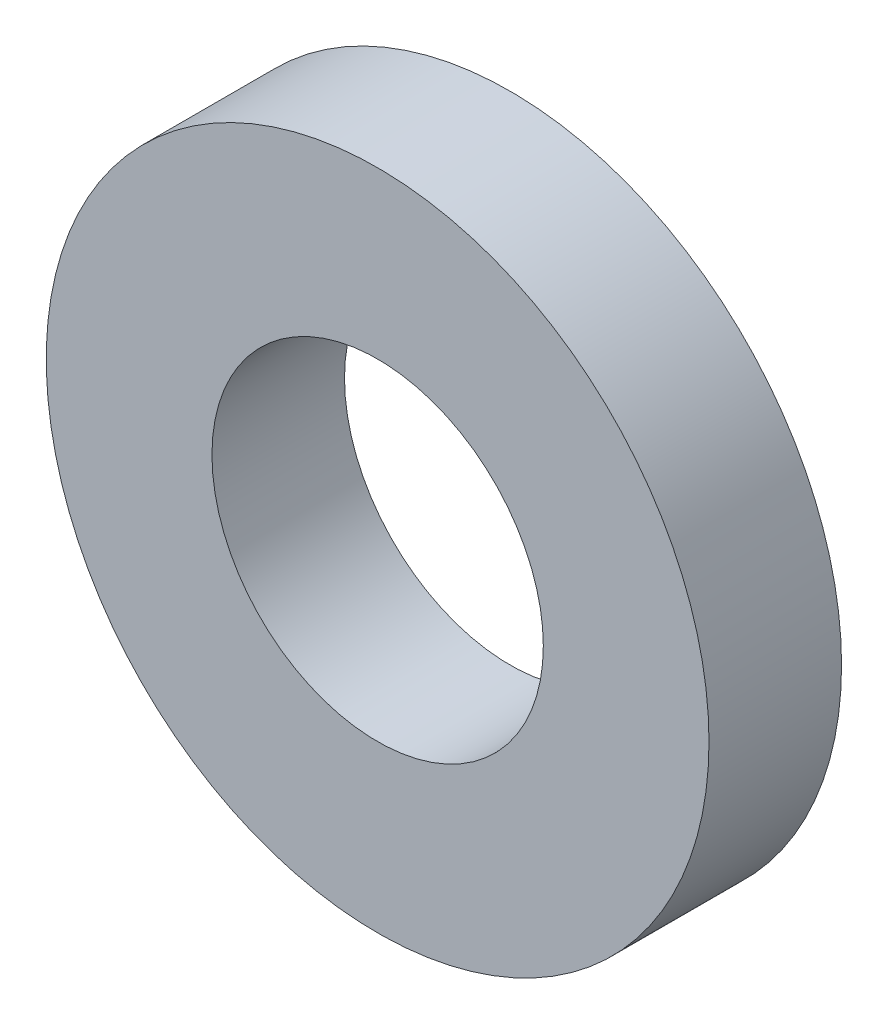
from build123d import *

# Parameters (mm, degrees)
ESQUISSE1_R      = 25
ESQUISSE1_R_2    = 12.5
EXTRUSION1_DEPTH = 10


with BuildPart() as part:
    # Esquisse1 → Extrusion1 (new body)
    with BuildSketch(Plane.XY):
        Circle(ESQUISSE1_R)
        Circle(ESQUISSE1_R_2, mode=Mode.SUBTRACT)
    extrude(amount=EXTRUSION1_DEPTH)


solid = part.part
